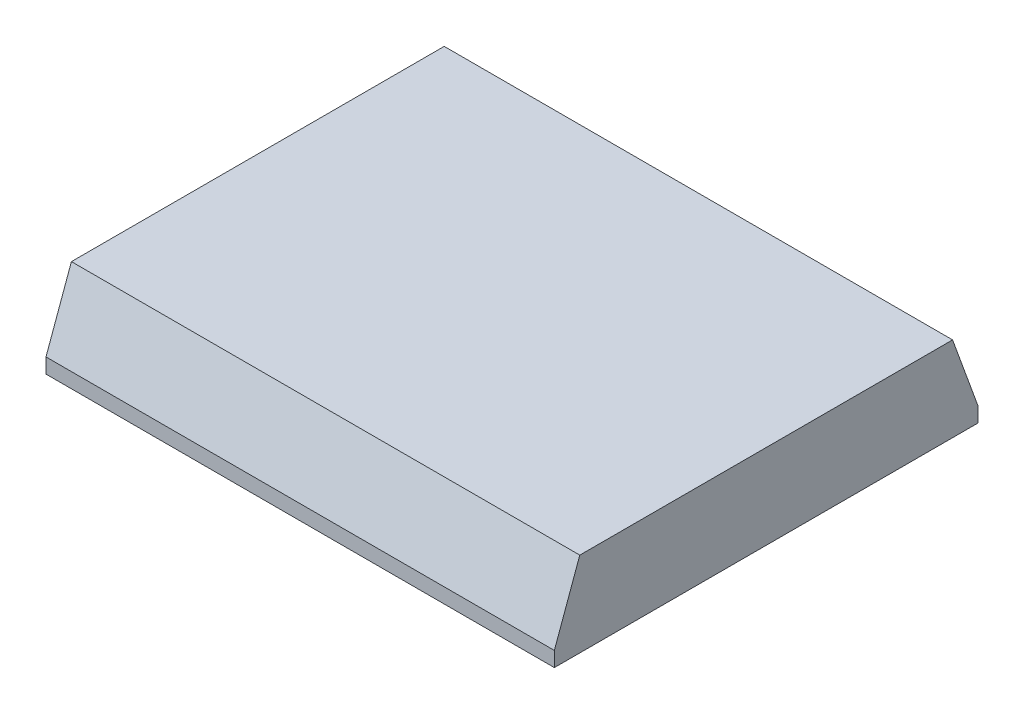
ISO-10303-21;
HEADER;
FILE_DESCRIPTION(('STEP AP214'),'2;1');
FILE_NAME('part.step','',(''),(''),'','','');
FILE_SCHEMA(('AUTOMOTIVE_DESIGN { 1 0 10303 214 1 1 1 1 }'));
ENDSEC;
DATA;
#1=APPLICATION_CONTEXT('core data for automotive mechanical design processes');
#2=APPLICATION_PROTOCOL_DEFINITION('international standard','automotive_design',2000,#1);
#3=PRODUCT_CONTEXT('',#1,'mechanical');
#4=PRODUCT('Part','Part','',(#3));
#5=PRODUCT_RELATED_PRODUCT_CATEGORY('part','',(#4));
#6=PRODUCT_DEFINITION_FORMATION('','',#4);
#7=PRODUCT_DEFINITION_CONTEXT('part definition',#1,'design');
#8=PRODUCT_DEFINITION('design','',#6,#7);
#9=PRODUCT_DEFINITION_SHAPE('','',#8);
#10=(LENGTH_UNIT() NAMED_UNIT(*) SI_UNIT(.MILLI.,.METRE.));
#11=(NAMED_UNIT(*) PLANE_ANGLE_UNIT() SI_UNIT($,.RADIAN.));
#12=(NAMED_UNIT(*) SI_UNIT($,.STERADIAN.) SOLID_ANGLE_UNIT());
#13=UNCERTAINTY_MEASURE_WITH_UNIT(LENGTH_MEASURE(1.E-05),#10,'distance_accuracy_value','');
#14=(GEOMETRIC_REPRESENTATION_CONTEXT(3) GLOBAL_UNCERTAINTY_ASSIGNED_CONTEXT((#13)) GLOBAL_UNIT_ASSIGNED_CONTEXT((#10,
#11,#12)) REPRESENTATION_CONTEXT('',''));
#15=CARTESIAN_POINT('',(0.,0.,0.));
#16=DIRECTION('',(0.,0.,1.));
#17=DIRECTION('',(1.,0.,0.));
#18=AXIS2_PLACEMENT_3D('',#15,#16,#17);
#19=CARTESIAN_POINT('',(60.,-5.,-25.));
#20=DIRECTION('',(0.,0.,1.));
#21=DIRECTION('',(1.,0.,0.));
#22=AXIS2_PLACEMENT_3D('',#19,#20,#21);
#23=PLANE('',#22);
#24=DIRECTION('',(0.,1.,0.));
#25=VECTOR('',#24,1.);
#26=CARTESIAN_POINT('',(0.,-5.,-25.));
#27=LINE('',#26,#25);
#28=CARTESIAN_POINT('',(0.,-5.,-25.));
#29=VERTEX_POINT('',#28);
#30=CARTESIAN_POINT('',(0.,-3.24243225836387,-25.));
#31=VERTEX_POINT('',#30);
#32=EDGE_CURVE('E113',#29,#31,#27,.T.);
#33=ORIENTED_EDGE('',*,*,#32,.T.);
#34=DIRECTION('',(1.,0.,0.));
#35=VECTOR('',#34,1.);
#36=CARTESIAN_POINT('',(60.,-3.24243225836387,-25.));
#37=LINE('',#36,#35);
#38=CARTESIAN_POINT('',(60.,-3.24243225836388,-25.));
#39=VERTEX_POINT('',#38);
#40=EDGE_CURVE('E40',#31,#39,#37,.T.);
#41=ORIENTED_EDGE('',*,*,#40,.T.);
#42=DIRECTION('',(0.,1.,0.));
#43=VECTOR('',#42,1.);
#44=CARTESIAN_POINT('',(60.,-5.,-25.));
#45=LINE('',#44,#43);
#46=CARTESIAN_POINT('',(60.,-5.,-25.));
#47=VERTEX_POINT('',#46);
#48=EDGE_CURVE('E119',#47,#39,#45,.T.);
#49=ORIENTED_EDGE('',*,*,#48,.F.);
#50=DIRECTION('',(-1.,0.,0.));
#51=VECTOR('',#50,1.);
#52=CARTESIAN_POINT('',(60.,-5.,-25.));
#53=LINE('',#52,#51);
#54=EDGE_CURVE('E105',#47,#29,#53,.T.);
#55=ORIENTED_EDGE('',*,*,#54,.T.);
#56=EDGE_LOOP('',(#33,#41,#49,#55));
#57=FACE_BOUND('',#56,.T.);
#58=ADVANCED_FACE('F32',(#57),#23,.F.);
#59=CARTESIAN_POINT('',(60.,5.,25.));
#60=DIRECTION('',(0.,-1.,0.));
#61=DIRECTION('',(0.,0.,-1.));
#62=AXIS2_PLACEMENT_3D('',#59,#60,#61);
#63=PLANE('',#62);
#64=DIRECTION('',(0.,0.,1.));
#65=VECTOR('',#64,1.);
#66=CARTESIAN_POINT('',(60.,5.,25.));
#67=LINE('',#66,#65);
#68=CARTESIAN_POINT('',(60.,5.,-22.));
#69=VERTEX_POINT('',#68);
#70=CARTESIAN_POINT('',(60.,5.,22.));
#71=VERTEX_POINT('',#70);
#72=EDGE_CURVE('E95',#69,#71,#67,.T.);
#73=ORIENTED_EDGE('',*,*,#72,.F.);
#74=DIRECTION('',(-1.,0.,0.));
#75=VECTOR('',#74,1.);
#76=CARTESIAN_POINT('',(60.,5.,-22.));
#77=LINE('',#76,#75);
#78=CARTESIAN_POINT('',(0.,5.,-22.));
#79=VERTEX_POINT('',#78);
#80=EDGE_CURVE('E129',#69,#79,#77,.T.);
#81=ORIENTED_EDGE('',*,*,#80,.T.);
#82=DIRECTION('',(0.,0.,1.));
#83=VECTOR('',#82,1.);
#84=CARTESIAN_POINT('',(0.,5.,25.));
#85=LINE('',#84,#83);
#86=CARTESIAN_POINT('',(0.,5.,22.));
#87=VERTEX_POINT('',#86);
#88=EDGE_CURVE('E115',#79,#87,#85,.T.);
#89=ORIENTED_EDGE('',*,*,#88,.T.);
#90=DIRECTION('',(1.,0.,0.));
#91=VECTOR('',#90,1.);
#92=CARTESIAN_POINT('',(60.,5.,22.));
#93=LINE('',#92,#91);
#94=EDGE_CURVE('E125',#87,#71,#93,.T.);
#95=ORIENTED_EDGE('',*,*,#94,.T.);
#96=EDGE_LOOP('',(#73,#81,#89,#95));
#97=FACE_BOUND('',#96,.T.);
#98=ADVANCED_FACE('F135',(#97),#63,.F.);
#99=CARTESIAN_POINT('',(60.,-5.,25.));
#100=DIRECTION('',(0.,0.,-1.));
#101=DIRECTION('',(-1.,0.,0.));
#102=AXIS2_PLACEMENT_3D('',#99,#100,#101);
#103=PLANE('',#102);
#104=DIRECTION('',(0.,-1.,0.));
#105=VECTOR('',#104,1.);
#106=CARTESIAN_POINT('',(60.,-5.,25.));
#107=LINE('',#106,#105);
#108=CARTESIAN_POINT('',(60.,-3.24243225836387,25.));
#109=VERTEX_POINT('',#108);
#110=CARTESIAN_POINT('',(60.,-5.,25.));
#111=VERTEX_POINT('',#110);
#112=EDGE_CURVE('E84',#109,#111,#107,.T.);
#113=ORIENTED_EDGE('',*,*,#112,.F.);
#114=DIRECTION('',(-1.,0.,0.));
#115=VECTOR('',#114,1.);
#116=CARTESIAN_POINT('',(60.,-3.24243225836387,25.));
#117=LINE('',#116,#115);
#118=CARTESIAN_POINT('',(0.,-3.24243225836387,25.));
#119=VERTEX_POINT('',#118);
#120=EDGE_CURVE('E104',#109,#119,#117,.T.);
#121=ORIENTED_EDGE('',*,*,#120,.T.);
#122=DIRECTION('',(0.,-1.,0.));
#123=VECTOR('',#122,1.);
#124=CARTESIAN_POINT('',(0.,-5.,25.));
#125=LINE('',#124,#123);
#126=CARTESIAN_POINT('',(0.,-5.,25.));
#127=VERTEX_POINT('',#126);
#128=EDGE_CURVE('E101',#119,#127,#125,.T.);
#129=ORIENTED_EDGE('',*,*,#128,.T.);
#130=DIRECTION('',(-1.,0.,0.));
#131=VECTOR('',#130,1.);
#132=CARTESIAN_POINT('',(60.,-5.,25.));
#133=LINE('',#132,#131);
#134=EDGE_CURVE('E98',#111,#127,#133,.T.);
#135=ORIENTED_EDGE('',*,*,#134,.F.);
#136=EDGE_LOOP('',(#113,#121,#129,#135));
#137=FACE_BOUND('',#136,.T.);
#138=ADVANCED_FACE('F99',(#137),#103,.F.);
#139=CARTESIAN_POINT('',(60.,-5.,25.));
#140=DIRECTION('',(0.,1.,0.));
#141=DIRECTION('',(0.,0.,1.));
#142=AXIS2_PLACEMENT_3D('',#139,#140,#141);
#143=PLANE('',#142);
#144=DIRECTION('',(0.,0.,-1.));
#145=VECTOR('',#144,1.);
#146=CARTESIAN_POINT('',(0.,-5.,25.));
#147=LINE('',#146,#145);
#148=EDGE_CURVE('E118',#127,#29,#147,.T.);
#149=ORIENTED_EDGE('',*,*,#148,.T.);
#150=ORIENTED_EDGE('',*,*,#54,.F.);
#151=DIRECTION('',(0.,0.,-1.));
#152=VECTOR('',#151,1.);
#153=CARTESIAN_POINT('',(60.,-5.,25.));
#154=LINE('',#153,#152);
#155=EDGE_CURVE('E88',#111,#47,#154,.T.);
#156=ORIENTED_EDGE('',*,*,#155,.F.);
#157=ORIENTED_EDGE('',*,*,#134,.T.);
#158=EDGE_LOOP('',(#149,#150,#156,#157));
#159=FACE_BOUND('',#158,.T.);
#160=ADVANCED_FACE('F107',(#159),#143,.F.);
#161=CARTESIAN_POINT('',(60.,0.,0.));
#162=DIRECTION('',(-1.,0.,0.));
#163=DIRECTION('',(0.,0.,1.));
#164=AXIS2_PLACEMENT_3D('',#161,#162,#163);
#165=PLANE('',#164);
#166=ORIENTED_EDGE('',*,*,#48,.T.);
#167=DIRECTION('',(0.,-0.939692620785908,-0.342020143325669));
#168=VECTOR('',#167,1.);
#169=CARTESIAN_POINT('',(60.,5.,-22.));
#170=LINE('',#169,#168);
#171=EDGE_CURVE('E11',#39,#69,#170,.F.);
#172=ORIENTED_EDGE('',*,*,#171,.T.);
#173=ORIENTED_EDGE('',*,*,#72,.T.);
#174=DIRECTION('',(0.,0.939692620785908,-0.342020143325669));
#175=VECTOR('',#174,1.);
#176=CARTESIAN_POINT('',(60.,-3.24243225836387,25.));
#177=LINE('',#176,#175);
#178=EDGE_CURVE('E91',#71,#109,#177,.F.);
#179=ORIENTED_EDGE('',*,*,#178,.T.);
#180=ORIENTED_EDGE('',*,*,#112,.T.);
#181=ORIENTED_EDGE('',*,*,#155,.T.);
#182=EDGE_LOOP('',(#166,#172,#173,#179,#180,#181));
#183=FACE_BOUND('',#182,.T.);
#184=ADVANCED_FACE('F86',(#183),#165,.F.);
#185=CARTESIAN_POINT('',(0.,0.,0.));
#186=DIRECTION('',(-1.,0.,0.));
#187=DIRECTION('',(0.,0.,1.));
#188=AXIS2_PLACEMENT_3D('',#185,#186,#187);
#189=PLANE('',#188);
#190=ORIENTED_EDGE('',*,*,#88,.F.);
#191=DIRECTION('',(0.,0.939692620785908,0.342020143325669));
#192=VECTOR('',#191,1.);
#193=CARTESIAN_POINT('',(0.,7.65555259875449,-21.0334578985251));
#194=LINE('',#193,#192);
#195=EDGE_CURVE('E54',#79,#31,#194,.F.);
#196=ORIENTED_EDGE('',*,*,#195,.T.);
#197=ORIENTED_EDGE('',*,*,#32,.F.);
#198=ORIENTED_EDGE('',*,*,#148,.F.);
#199=ORIENTED_EDGE('',*,*,#128,.F.);
#200=DIRECTION('',(0.,-0.939692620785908,0.342020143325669));
#201=VECTOR('',#200,1.);
#202=CARTESIAN_POINT('',(0.,7.6555525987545,21.0334578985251));
#203=LINE('',#202,#201);
#204=EDGE_CURVE('E122',#119,#87,#203,.F.);
#205=ORIENTED_EDGE('',*,*,#204,.T.);
#206=EDGE_LOOP('',(#190,#196,#197,#198,#199,#205));
#207=FACE_BOUND('',#206,.T.);
#208=ADVANCED_FACE('F138',(#207),#189,.T.);
#209=CARTESIAN_POINT('',(60.,-3.24243225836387,25.));
#210=DIRECTION('',(0.,-0.342020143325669,-0.939692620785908));
#211=DIRECTION('',(-1.,0.,0.));
#212=AXIS2_PLACEMENT_3D('',#209,#210,#211);
#213=PLANE('',#212);
#214=ORIENTED_EDGE('',*,*,#178,.F.);
#215=ORIENTED_EDGE('',*,*,#94,.F.);
#216=ORIENTED_EDGE('',*,*,#204,.F.);
#217=ORIENTED_EDGE('',*,*,#120,.F.);
#218=EDGE_LOOP('',(#214,#215,#216,#217));
#219=FACE_BOUND('',#218,.T.);
#220=ADVANCED_FACE('F141',(#219),#213,.F.);
#221=CARTESIAN_POINT('',(60.,5.,-22.));
#222=DIRECTION('',(0.,-0.342020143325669,0.939692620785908));
#223=DIRECTION('',(-1.,0.,0.));
#224=AXIS2_PLACEMENT_3D('',#221,#222,#223);
#225=PLANE('',#224);
#226=ORIENTED_EDGE('',*,*,#171,.F.);
#227=ORIENTED_EDGE('',*,*,#40,.F.);
#228=ORIENTED_EDGE('',*,*,#195,.F.);
#229=ORIENTED_EDGE('',*,*,#80,.F.);
#230=EDGE_LOOP('',(#226,#227,#228,#229));
#231=FACE_BOUND('',#230,.T.);
#232=ADVANCED_FACE('F34',(#231),#225,.F.);
#233=CLOSED_SHELL('',(#58,#98,#138,#160,#184,#208,#220,#232));
#234=MANIFOLD_SOLID_BREP('B2',#233);
#235=ADVANCED_BREP_SHAPE_REPRESENTATION('',(#18,#234),#14);
#236=SHAPE_DEFINITION_REPRESENTATION(#9,#235);
ENDSEC;
END-ISO-10303-21;
